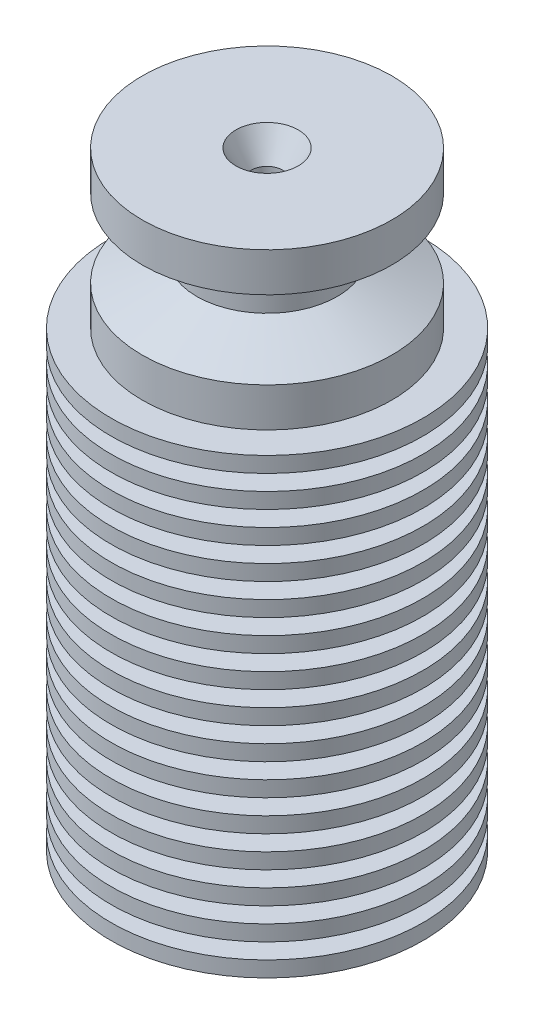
from build123d import *

# Parameters (mm, degrees)
ESQUISSE3_R                = 10
ESQUISSE3_R_2              = 2
BOSS_EXTRU_1_DEPTH         = 1
R_P_TITION_LIN_AIRE1_COUNT = 15
R_P_TITION_LIN_AIRE1_PITCH = 2
CHANFREIN1_SIZE            = 1
CHANFREIN1_SIZE2           = 1.732050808
CHANFREIN3_SIZE            = 0.5


with BuildPart() as part:
    # Esquisse2 → R_volution1 (revolve)
    with BuildSketch(Plane.XY, mode=Mode.PRIVATE) as r_volution1_sk:
        Polygon((-1, 0), (-1, -44), (-3, -44), (-3, -40), (-2, -40), (-2, -10), (-8, -10), (-8, -7.5), (-4.5, -6), (-4.5, -4), (-8, -2.5), (-8, 0), align=None)
    revolve(r_volution1_sk.sketch.rotate(Axis((0, 9.191211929, 0), (0, -1, 0)), 270), axis=Axis((0, 9.191211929, 0), (0, -1, 0)))

    # Esquisse3 → Boss.-Extru.1 (add)
    with BuildSketch(Plane.XZ.offset(10)):
        with Locations(Location((0, 0, 0), (0, 0, 270))):
            Circle(ESQUISSE3_R)
        with Locations(Location((0, 0, 0), (0, 0, 90))):
            Circle(ESQUISSE3_R_2, mode=Mode.SUBTRACT)
    boss_extru_1 = extrude(amount=BOSS_EXTRU_1_DEPTH)

    # R_p_tition lin_aire1: Boss.-Extru.1 ×15
    with Locations(*[(0, -i * R_P_TITION_LIN_AIRE1_PITCH, 0) for i in range(1, R_P_TITION_LIN_AIRE1_COUNT)]):
        add(boss_extru_1)

    # Chanfrein1
    chanfrein1_edges = [part.edges().sort_by_distance(p)[0] for p in [
        (0, 0, -1),
    ]]
    chanfrein1_side = [part.faces().sort_by_distance(p)[0] for p in [
        (0, 0, -7.77372583),
    ]]
    chamfer(chanfrein1_edges, length=CHANFREIN1_SIZE, length2=CHANFREIN1_SIZE2, reference=chanfrein1_side[0])

    # Chanfrein3
    chanfrein3_edges = [part.edges().sort_by_distance(p)[0] for p in [
        (0, -40, -3),
        (0, -44, -3),
    ]]
    chamfer(chanfrein3_edges, length=CHANFREIN3_SIZE)


solid = part.part
